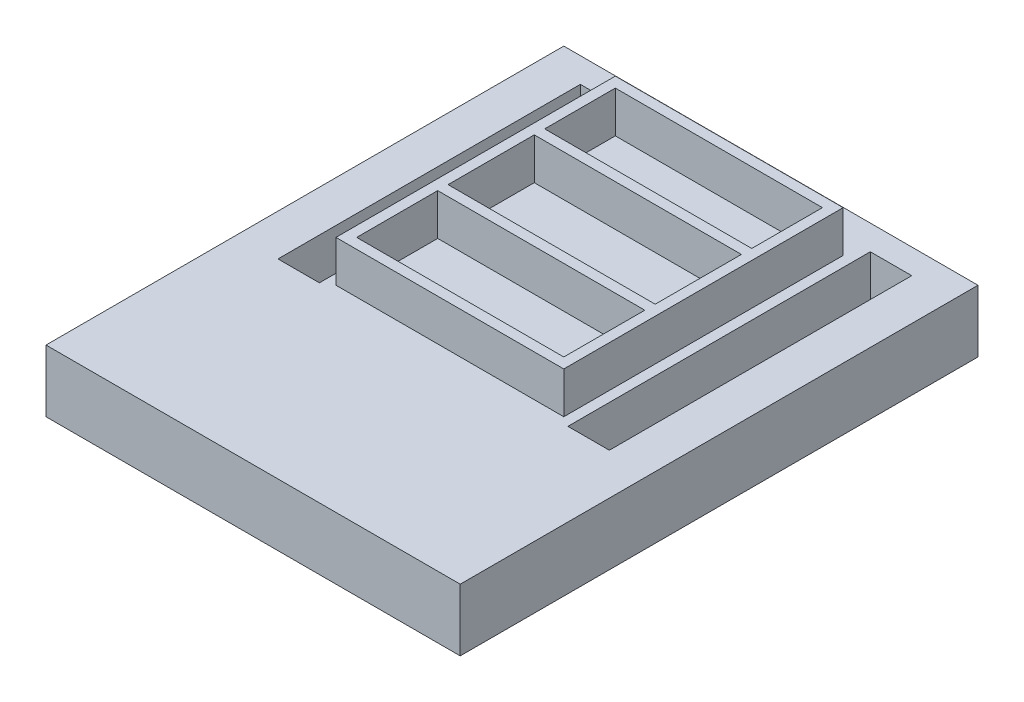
ISO-10303-21;
HEADER;
FILE_DESCRIPTION(('STEP AP214'),'2;1');
FILE_NAME('part.step','',(''),(''),'','','');
FILE_SCHEMA(('AUTOMOTIVE_DESIGN { 1 0 10303 214 1 1 1 1 }'));
ENDSEC;
DATA;
#1=APPLICATION_CONTEXT('core data for automotive mechanical design processes');
#2=APPLICATION_PROTOCOL_DEFINITION('international standard','automotive_design',2000,#1);
#3=PRODUCT_CONTEXT('',#1,'mechanical');
#4=PRODUCT('Part','Part','',(#3));
#5=PRODUCT_RELATED_PRODUCT_CATEGORY('part','',(#4));
#6=PRODUCT_DEFINITION_FORMATION('','',#4);
#7=PRODUCT_DEFINITION_CONTEXT('part definition',#1,'design');
#8=PRODUCT_DEFINITION('design','',#6,#7);
#9=PRODUCT_DEFINITION_SHAPE('','',#8);
#10=(LENGTH_UNIT() NAMED_UNIT(*) SI_UNIT(.MILLI.,.METRE.));
#11=(NAMED_UNIT(*) PLANE_ANGLE_UNIT() SI_UNIT($,.RADIAN.));
#12=(NAMED_UNIT(*) SI_UNIT($,.STERADIAN.) SOLID_ANGLE_UNIT());
#13=UNCERTAINTY_MEASURE_WITH_UNIT(LENGTH_MEASURE(1.E-05),#10,'distance_accuracy_value','');
#14=(GEOMETRIC_REPRESENTATION_CONTEXT(3) GLOBAL_UNCERTAINTY_ASSIGNED_CONTEXT((#13)) GLOBAL_UNIT_ASSIGNED_CONTEXT((#10,
#11,#12)) REPRESENTATION_CONTEXT('',''));
#15=CARTESIAN_POINT('',(0.,0.,0.));
#16=DIRECTION('',(0.,0.,1.));
#17=DIRECTION('',(1.,0.,0.));
#18=AXIS2_PLACEMENT_3D('',#15,#16,#17);
#19=CARTESIAN_POINT('',(99.9999999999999,30.,-125.));
#20=DIRECTION('',(-1.,0.,0.));
#21=DIRECTION('',(0.,0.,1.));
#22=AXIS2_PLACEMENT_3D('',#19,#20,#21);
#23=PLANE('',#22);
#24=DIRECTION('',(0.,0.,-1.));
#25=VECTOR('',#24,1.);
#26=CARTESIAN_POINT('',(99.9999999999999,0.,-125.));
#27=LINE('',#26,#25);
#28=CARTESIAN_POINT('',(100.,0.,125.));
#29=VERTEX_POINT('',#28);
#30=CARTESIAN_POINT('',(99.9999999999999,0.,-125.));
#31=VERTEX_POINT('',#30);
#32=EDGE_CURVE('E327',#29,#31,#27,.T.);
#33=ORIENTED_EDGE('',*,*,#32,.T.);
#34=DIRECTION('',(0.,-1.,0.));
#35=VECTOR('',#34,1.);
#36=CARTESIAN_POINT('',(99.9999999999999,30.,-125.));
#37=LINE('',#36,#35);
#38=CARTESIAN_POINT('',(99.9999999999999,30.,-125.));
#39=VERTEX_POINT('',#38);
#40=EDGE_CURVE('E11',#39,#31,#37,.T.);
#41=ORIENTED_EDGE('',*,*,#40,.F.);
#42=DIRECTION('',(0.,0.,-1.));
#43=VECTOR('',#42,1.);
#44=CARTESIAN_POINT('',(99.9999999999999,30.,-125.));
#45=LINE('',#44,#43);
#46=CARTESIAN_POINT('',(100.,30.,125.));
#47=VERTEX_POINT('',#46);
#48=EDGE_CURVE('E328',#47,#39,#45,.T.);
#49=ORIENTED_EDGE('',*,*,#48,.F.);
#50=DIRECTION('',(0.,-1.,0.));
#51=VECTOR('',#50,1.);
#52=CARTESIAN_POINT('',(100.,30.,125.));
#53=LINE('',#52,#51);
#54=EDGE_CURVE('E338',#47,#29,#53,.T.);
#55=ORIENTED_EDGE('',*,*,#54,.T.);
#56=EDGE_LOOP('',(#33,#41,#49,#55));
#57=FACE_BOUND('',#56,.T.);
#58=ADVANCED_FACE('F41',(#57),#23,.F.);
#59=CARTESIAN_POINT('',(-100.,30.,-125.));
#60=DIRECTION('',(0.,0.,1.));
#61=DIRECTION('',(1.,0.,0.));
#62=AXIS2_PLACEMENT_3D('',#59,#60,#61);
#63=PLANE('',#62);
#64=DIRECTION('',(-1.,0.,0.));
#65=VECTOR('',#64,1.);
#66=CARTESIAN_POINT('',(-100.,0.,-125.));
#67=LINE('',#66,#65);
#68=CARTESIAN_POINT('',(-100.,0.,-125.));
#69=VERTEX_POINT('',#68);
#70=EDGE_CURVE('E341',#31,#69,#67,.T.);
#71=ORIENTED_EDGE('',*,*,#70,.T.);
#72=DIRECTION('',(0.,-1.,0.));
#73=VECTOR('',#72,1.);
#74=CARTESIAN_POINT('',(-100.,30.,-125.));
#75=LINE('',#74,#73);
#76=CARTESIAN_POINT('',(-100.,30.,-125.));
#77=VERTEX_POINT('',#76);
#78=EDGE_CURVE('E48',#77,#69,#75,.T.);
#79=ORIENTED_EDGE('',*,*,#78,.F.);
#80=DIRECTION('',(-1.,0.,0.));
#81=VECTOR('',#80,1.);
#82=CARTESIAN_POINT('',(-100.,30.,-125.));
#83=LINE('',#82,#81);
#84=EDGE_CURVE('E331',#39,#77,#83,.T.);
#85=ORIENTED_EDGE('',*,*,#84,.F.);
#86=ORIENTED_EDGE('',*,*,#40,.T.);
#87=EDGE_LOOP('',(#71,#79,#85,#86));
#88=FACE_BOUND('',#87,.T.);
#89=ADVANCED_FACE('F371',(#88),#63,.F.);
#90=CARTESIAN_POINT('',(-100.,30.,-125.));
#91=DIRECTION('',(1.,0.,0.));
#92=DIRECTION('',(0.,0.,-1.));
#93=AXIS2_PLACEMENT_3D('',#90,#91,#92);
#94=PLANE('',#93);
#95=DIRECTION('',(0.,0.,1.));
#96=VECTOR('',#95,1.);
#97=CARTESIAN_POINT('',(-100.,0.,-125.));
#98=LINE('',#97,#96);
#99=CARTESIAN_POINT('',(-100.,0.,125.));
#100=VERTEX_POINT('',#99);
#101=EDGE_CURVE('E343',#69,#100,#98,.T.);
#102=ORIENTED_EDGE('',*,*,#101,.T.);
#103=DIRECTION('',(0.,-1.,0.));
#104=VECTOR('',#103,1.);
#105=CARTESIAN_POINT('',(-100.,30.,125.));
#106=LINE('',#105,#104);
#107=CARTESIAN_POINT('',(-100.,30.,125.));
#108=VERTEX_POINT('',#107);
#109=EDGE_CURVE('E348',#108,#100,#106,.T.);
#110=ORIENTED_EDGE('',*,*,#109,.F.);
#111=DIRECTION('',(0.,0.,1.));
#112=VECTOR('',#111,1.);
#113=CARTESIAN_POINT('',(-100.,30.,-125.));
#114=LINE('',#113,#112);
#115=EDGE_CURVE('E334',#77,#108,#114,.T.);
#116=ORIENTED_EDGE('',*,*,#115,.F.);
#117=ORIENTED_EDGE('',*,*,#78,.T.);
#118=EDGE_LOOP('',(#102,#110,#116,#117));
#119=FACE_BOUND('',#118,.T.);
#120=ADVANCED_FACE('F355',(#119),#94,.F.);
#121=CARTESIAN_POINT('',(-100.,30.,125.));
#122=DIRECTION('',(0.,0.,-1.));
#123=DIRECTION('',(-1.,0.,0.));
#124=AXIS2_PLACEMENT_3D('',#121,#122,#123);
#125=PLANE('',#124);
#126=DIRECTION('',(1.,0.,0.));
#127=VECTOR('',#126,1.);
#128=CARTESIAN_POINT('',(-100.,0.,125.));
#129=LINE('',#128,#127);
#130=EDGE_CURVE('E332',#100,#29,#129,.T.);
#131=ORIENTED_EDGE('',*,*,#130,.T.);
#132=ORIENTED_EDGE('',*,*,#54,.F.);
#133=DIRECTION('',(1.,0.,0.));
#134=VECTOR('',#133,1.);
#135=CARTESIAN_POINT('',(-100.,30.,125.));
#136=LINE('',#135,#134);
#137=EDGE_CURVE('E336',#108,#47,#136,.T.);
#138=ORIENTED_EDGE('',*,*,#137,.F.);
#139=ORIENTED_EDGE('',*,*,#109,.T.);
#140=EDGE_LOOP('',(#131,#132,#138,#139));
#141=FACE_BOUND('',#140,.T.);
#142=ADVANCED_FACE('F364',(#141),#125,.F.);
#143=CARTESIAN_POINT('',(0.,30.,0.));
#144=DIRECTION('',(0.,1.,0.));
#145=DIRECTION('',(0.,0.,1.));
#146=AXIS2_PLACEMENT_3D('',#143,#144,#145);
#147=PLANE('',#146);
#148=DIRECTION('',(1.,0.,0.));
#149=VECTOR('',#148,1.);
#150=CARTESIAN_POINT('',(0.,30.,-104.89));
#151=LINE('',#150,#149);
#152=CARTESIAN_POINT('',(-55.,30.,-104.89));
#153=VERTEX_POINT('',#152);
#154=CARTESIAN_POINT('',(55.,30.,-104.89));
#155=VERTEX_POINT('',#154);
#156=EDGE_CURVE('E546',#153,#155,#151,.T.);
#157=ORIENTED_EDGE('',*,*,#156,.T.);
#158=DIRECTION('',(0.,0.,1.));
#159=VECTOR('',#158,1.);
#160=CARTESIAN_POINT('',(55.,30.,0.));
#161=LINE('',#160,#159);
#162=CARTESIAN_POINT('',(55.,30.,30.));
#163=VERTEX_POINT('',#162);
#164=EDGE_CURVE('E499',#155,#163,#161,.T.);
#165=ORIENTED_EDGE('',*,*,#164,.T.);
#166=DIRECTION('',(1.,0.,0.));
#167=VECTOR('',#166,1.);
#168=CARTESIAN_POINT('',(0.,30.,30.));
#169=LINE('',#168,#167);
#170=CARTESIAN_POINT('',(-55.,30.,30.));
#171=VERTEX_POINT('',#170);
#172=EDGE_CURVE('E60',#171,#163,#169,.T.);
#173=ORIENTED_EDGE('',*,*,#172,.F.);
#174=DIRECTION('',(0.,0.,1.));
#175=VECTOR('',#174,1.);
#176=CARTESIAN_POINT('',(-55.,30.,0.));
#177=LINE('',#176,#175);
#178=EDGE_CURVE('E55',#153,#171,#177,.T.);
#179=ORIENTED_EDGE('',*,*,#178,.F.);
#180=EDGE_LOOP('',(#157,#165,#173,#179));
#181=FACE_BOUND('',#180,.T.);
#182=DIRECTION('',(0.,0.,-1.));
#183=VECTOR('',#182,1.);
#184=CARTESIAN_POINT('',(80.,30.,0.));
#185=LINE('',#184,#183);
#186=CARTESIAN_POINT('',(80.,30.,33.));
#187=VERTEX_POINT('',#186);
#188=CARTESIAN_POINT('',(80.,30.,-113.));
#189=VERTEX_POINT('',#188);
#190=EDGE_CURVE('E324',#187,#189,#185,.T.);
#191=ORIENTED_EDGE('',*,*,#190,.F.);
#192=DIRECTION('',(1.,0.,0.));
#193=VECTOR('',#192,1.);
#194=CARTESIAN_POINT('',(0.,30.,33.));
#195=LINE('',#194,#193);
#196=CARTESIAN_POINT('',(60.,30.,33.));
#197=VERTEX_POINT('',#196);
#198=EDGE_CURVE('E322',#197,#187,#195,.T.);
#199=ORIENTED_EDGE('',*,*,#198,.F.);
#200=DIRECTION('',(0.,0.,1.));
#201=VECTOR('',#200,1.);
#202=CARTESIAN_POINT('',(60.,30.,0.));
#203=LINE('',#202,#201);
#204=CARTESIAN_POINT('',(60.,30.,-113.));
#205=VERTEX_POINT('',#204);
#206=EDGE_CURVE('E320',#205,#197,#203,.T.);
#207=ORIENTED_EDGE('',*,*,#206,.F.);
#208=DIRECTION('',(-1.,0.,0.));
#209=VECTOR('',#208,1.);
#210=CARTESIAN_POINT('',(0.,30.,-113.));
#211=LINE('',#210,#209);
#212=EDGE_CURVE('E318',#189,#205,#211,.T.);
#213=ORIENTED_EDGE('',*,*,#212,.F.);
#214=EDGE_LOOP('',(#191,#199,#207,#213));
#215=FACE_BOUND('',#214,.T.);
#216=DIRECTION('',(0.,0.,1.));
#217=VECTOR('',#216,1.);
#218=CARTESIAN_POINT('',(-80.,30.,0.));
#219=LINE('',#218,#217);
#220=CARTESIAN_POINT('',(-80.,30.,-113.));
#221=VERTEX_POINT('',#220);
#222=CARTESIAN_POINT('',(-80.,30.,33.));
#223=VERTEX_POINT('',#222);
#224=EDGE_CURVE('E315',#221,#223,#219,.T.);
#225=ORIENTED_EDGE('',*,*,#224,.F.);
#226=DIRECTION('',(-1.,0.,0.));
#227=VECTOR('',#226,1.);
#228=CARTESIAN_POINT('',(0.,30.,-113.));
#229=LINE('',#228,#227);
#230=CARTESIAN_POINT('',(-60.,30.,-113.));
#231=VERTEX_POINT('',#230);
#232=EDGE_CURVE('E313',#231,#221,#229,.T.);
#233=ORIENTED_EDGE('',*,*,#232,.F.);
#234=DIRECTION('',(0.,0.,-1.));
#235=VECTOR('',#234,1.);
#236=CARTESIAN_POINT('',(-60.,30.,0.));
#237=LINE('',#236,#235);
#238=CARTESIAN_POINT('',(-60.,30.,33.));
#239=VERTEX_POINT('',#238);
#240=EDGE_CURVE('E311',#239,#231,#237,.T.);
#241=ORIENTED_EDGE('',*,*,#240,.F.);
#242=DIRECTION('',(1.,0.,0.));
#243=VECTOR('',#242,1.);
#244=CARTESIAN_POINT('',(0.,30.,33.));
#245=LINE('',#244,#243);
#246=EDGE_CURVE('E279',#223,#239,#245,.T.);
#247=ORIENTED_EDGE('',*,*,#246,.F.);
#248=EDGE_LOOP('',(#225,#233,#241,#247));
#249=FACE_BOUND('',#248,.T.);
#250=ORIENTED_EDGE('',*,*,#48,.T.);
#251=ORIENTED_EDGE('',*,*,#84,.T.);
#252=ORIENTED_EDGE('',*,*,#115,.T.);
#253=ORIENTED_EDGE('',*,*,#137,.T.);
#254=EDGE_LOOP('',(#250,#251,#252,#253));
#255=FACE_BOUND('',#254,.T.);
#256=ADVANCED_FACE('F370',(#181,#215,#249,#255),#147,.T.);
#257=CARTESIAN_POINT('',(0.,0.,0.));
#258=DIRECTION('',(0.,1.,0.));
#259=DIRECTION('',(0.,0.,1.));
#260=AXIS2_PLACEMENT_3D('',#257,#258,#259);
#261=PLANE('',#260);
#262=DIRECTION('',(1.,0.,0.));
#263=VECTOR('',#262,1.);
#264=CARTESIAN_POINT('',(80.,0.,33.));
#265=LINE('',#264,#263);
#266=CARTESIAN_POINT('',(60.,0.,33.));
#267=VERTEX_POINT('',#266);
#268=CARTESIAN_POINT('',(80.,0.,33.));
#269=VERTEX_POINT('',#268);
#270=EDGE_CURVE('E272',#267,#269,#265,.T.);
#271=ORIENTED_EDGE('',*,*,#270,.T.);
#272=DIRECTION('',(0.,0.,-1.));
#273=VECTOR('',#272,1.);
#274=CARTESIAN_POINT('',(80.,0.,-113.));
#275=LINE('',#274,#273);
#276=CARTESIAN_POINT('',(80.,0.,-113.));
#277=VERTEX_POINT('',#276);
#278=EDGE_CURVE('E262',#269,#277,#275,.T.);
#279=ORIENTED_EDGE('',*,*,#278,.T.);
#280=DIRECTION('',(-1.,0.,0.));
#281=VECTOR('',#280,1.);
#282=CARTESIAN_POINT('',(80.,0.,-113.));
#283=LINE('',#282,#281);
#284=CARTESIAN_POINT('',(60.,0.,-113.));
#285=VERTEX_POINT('',#284);
#286=EDGE_CURVE('E265',#277,#285,#283,.T.);
#287=ORIENTED_EDGE('',*,*,#286,.T.);
#288=DIRECTION('',(0.,0.,1.));
#289=VECTOR('',#288,1.);
#290=CARTESIAN_POINT('',(60.,0.,-113.));
#291=LINE('',#290,#289);
#292=EDGE_CURVE('E269',#285,#267,#291,.T.);
#293=ORIENTED_EDGE('',*,*,#292,.T.);
#294=EDGE_LOOP('',(#271,#279,#287,#293));
#295=FACE_BOUND('',#294,.T.);
#296=DIRECTION('',(-1.,0.,0.));
#297=VECTOR('',#296,1.);
#298=CARTESIAN_POINT('',(-80.,0.,-113.));
#299=LINE('',#298,#297);
#300=CARTESIAN_POINT('',(-60.,0.,-113.));
#301=VERTEX_POINT('',#300);
#302=CARTESIAN_POINT('',(-80.,0.,-113.));
#303=VERTEX_POINT('',#302);
#304=EDGE_CURVE('E289',#301,#303,#299,.T.);
#305=ORIENTED_EDGE('',*,*,#304,.T.);
#306=DIRECTION('',(0.,0.,1.));
#307=VECTOR('',#306,1.);
#308=CARTESIAN_POINT('',(-80.,0.,-113.));
#309=LINE('',#308,#307);
#310=CARTESIAN_POINT('',(-80.,0.,33.));
#311=VERTEX_POINT('',#310);
#312=EDGE_CURVE('E266',#303,#311,#309,.T.);
#313=ORIENTED_EDGE('',*,*,#312,.T.);
#314=DIRECTION('',(1.,0.,0.));
#315=VECTOR('',#314,1.);
#316=CARTESIAN_POINT('',(-80.,0.,33.));
#317=LINE('',#316,#315);
#318=CARTESIAN_POINT('',(-60.,0.,33.));
#319=VERTEX_POINT('',#318);
#320=EDGE_CURVE('E305',#311,#319,#317,.T.);
#321=ORIENTED_EDGE('',*,*,#320,.T.);
#322=DIRECTION('',(0.,0.,-1.));
#323=VECTOR('',#322,1.);
#324=CARTESIAN_POINT('',(-60.,0.,-113.));
#325=LINE('',#324,#323);
#326=EDGE_CURVE('E302',#319,#301,#325,.T.);
#327=ORIENTED_EDGE('',*,*,#326,.T.);
#328=EDGE_LOOP('',(#305,#313,#321,#327));
#329=FACE_BOUND('',#328,.T.);
#330=ORIENTED_EDGE('',*,*,#32,.F.);
#331=ORIENTED_EDGE('',*,*,#130,.F.);
#332=ORIENTED_EDGE('',*,*,#101,.F.);
#333=ORIENTED_EDGE('',*,*,#70,.F.);
#334=EDGE_LOOP('',(#330,#331,#332,#333));
#335=FACE_BOUND('',#334,.T.);
#336=ADVANCED_FACE('F361',(#295,#329,#335),#261,.F.);
#337=CARTESIAN_POINT('',(-80.,0.,-113.));
#338=DIRECTION('',(-1.,0.,0.));
#339=DIRECTION('',(0.,0.,1.));
#340=AXIS2_PLACEMENT_3D('',#337,#338,#339);
#341=PLANE('',#340);
#342=ORIENTED_EDGE('',*,*,#224,.T.);
#343=DIRECTION('',(0.,1.,0.));
#344=VECTOR('',#343,1.);
#345=CARTESIAN_POINT('',(-80.,0.,33.));
#346=LINE('',#345,#344);
#347=EDGE_CURVE('E287',#311,#223,#346,.T.);
#348=ORIENTED_EDGE('',*,*,#347,.F.);
#349=ORIENTED_EDGE('',*,*,#312,.F.);
#350=DIRECTION('',(0.,1.,0.));
#351=VECTOR('',#350,1.);
#352=CARTESIAN_POINT('',(-80.,0.,-113.));
#353=LINE('',#352,#351);
#354=EDGE_CURVE('E296',#303,#221,#353,.T.);
#355=ORIENTED_EDGE('',*,*,#354,.T.);
#356=EDGE_LOOP('',(#342,#348,#349,#355));
#357=FACE_BOUND('',#356,.T.);
#358=ADVANCED_FACE('F383',(#357),#341,.F.);
#359=CARTESIAN_POINT('',(-80.,0.,-113.));
#360=DIRECTION('',(0.,0.,-1.));
#361=DIRECTION('',(-1.,0.,0.));
#362=AXIS2_PLACEMENT_3D('',#359,#360,#361);
#363=PLANE('',#362);
#364=ORIENTED_EDGE('',*,*,#232,.T.);
#365=ORIENTED_EDGE('',*,*,#354,.F.);
#366=ORIENTED_EDGE('',*,*,#304,.F.);
#367=DIRECTION('',(0.,1.,0.));
#368=VECTOR('',#367,1.);
#369=CARTESIAN_POINT('',(-60.,0.,-113.));
#370=LINE('',#369,#368);
#371=EDGE_CURVE('E293',#301,#231,#370,.T.);
#372=ORIENTED_EDGE('',*,*,#371,.T.);
#373=EDGE_LOOP('',(#364,#365,#366,#372));
#374=FACE_BOUND('',#373,.T.);
#375=ADVANCED_FACE('F389',(#374),#363,.F.);
#376=CARTESIAN_POINT('',(-60.,0.,-113.));
#377=DIRECTION('',(1.,0.,0.));
#378=DIRECTION('',(0.,0.,-1.));
#379=AXIS2_PLACEMENT_3D('',#376,#377,#378);
#380=PLANE('',#379);
#381=ORIENTED_EDGE('',*,*,#240,.T.);
#382=ORIENTED_EDGE('',*,*,#371,.F.);
#383=ORIENTED_EDGE('',*,*,#326,.F.);
#384=DIRECTION('',(0.,1.,0.));
#385=VECTOR('',#384,1.);
#386=CARTESIAN_POINT('',(-60.,0.,33.));
#387=LINE('',#386,#385);
#388=EDGE_CURVE('E290',#319,#239,#387,.T.);
#389=ORIENTED_EDGE('',*,*,#388,.T.);
#390=EDGE_LOOP('',(#381,#382,#383,#389));
#391=FACE_BOUND('',#390,.T.);
#392=ADVANCED_FACE('F392',(#391),#380,.F.);
#393=CARTESIAN_POINT('',(-80.,0.,33.));
#394=DIRECTION('',(0.,0.,1.));
#395=DIRECTION('',(1.,0.,0.));
#396=AXIS2_PLACEMENT_3D('',#393,#394,#395);
#397=PLANE('',#396);
#398=ORIENTED_EDGE('',*,*,#246,.T.);
#399=ORIENTED_EDGE('',*,*,#388,.F.);
#400=ORIENTED_EDGE('',*,*,#320,.F.);
#401=ORIENTED_EDGE('',*,*,#347,.T.);
#402=EDGE_LOOP('',(#398,#399,#400,#401));
#403=FACE_BOUND('',#402,.T.);
#404=ADVANCED_FACE('F396',(#403),#397,.F.);
#405=CARTESIAN_POINT('',(80.,0.,-113.));
#406=DIRECTION('',(1.,0.,0.));
#407=DIRECTION('',(0.,0.,-1.));
#408=AXIS2_PLACEMENT_3D('',#405,#406,#407);
#409=PLANE('',#408);
#410=ORIENTED_EDGE('',*,*,#190,.T.);
#411=DIRECTION('',(0.,1.,0.));
#412=VECTOR('',#411,1.);
#413=CARTESIAN_POINT('',(80.,0.,-113.));
#414=LINE('',#413,#412);
#415=EDGE_CURVE('E275',#277,#189,#414,.T.);
#416=ORIENTED_EDGE('',*,*,#415,.F.);
#417=ORIENTED_EDGE('',*,*,#278,.F.);
#418=DIRECTION('',(0.,1.,0.));
#419=VECTOR('',#418,1.);
#420=CARTESIAN_POINT('',(80.,0.,33.));
#421=LINE('',#420,#419);
#422=EDGE_CURVE('E276',#269,#187,#421,.T.);
#423=ORIENTED_EDGE('',*,*,#422,.T.);
#424=EDGE_LOOP('',(#410,#416,#417,#423));
#425=FACE_BOUND('',#424,.T.);
#426=ADVANCED_FACE('F400',(#425),#409,.F.);
#427=CARTESIAN_POINT('',(80.,0.,33.));
#428=DIRECTION('',(0.,0.,1.));
#429=DIRECTION('',(1.,0.,0.));
#430=AXIS2_PLACEMENT_3D('',#427,#428,#429);
#431=PLANE('',#430);
#432=ORIENTED_EDGE('',*,*,#198,.T.);
#433=ORIENTED_EDGE('',*,*,#422,.F.);
#434=ORIENTED_EDGE('',*,*,#270,.F.);
#435=DIRECTION('',(0.,1.,0.));
#436=VECTOR('',#435,1.);
#437=CARTESIAN_POINT('',(60.,0.,33.));
#438=LINE('',#437,#436);
#439=EDGE_CURVE('E280',#267,#197,#438,.T.);
#440=ORIENTED_EDGE('',*,*,#439,.T.);
#441=EDGE_LOOP('',(#432,#433,#434,#440));
#442=FACE_BOUND('',#441,.T.);
#443=ADVANCED_FACE('F407',(#442),#431,.F.);
#444=CARTESIAN_POINT('',(60.,0.,-113.));
#445=DIRECTION('',(-1.,0.,0.));
#446=DIRECTION('',(0.,0.,1.));
#447=AXIS2_PLACEMENT_3D('',#444,#445,#446);
#448=PLANE('',#447);
#449=ORIENTED_EDGE('',*,*,#206,.T.);
#450=ORIENTED_EDGE('',*,*,#439,.F.);
#451=ORIENTED_EDGE('',*,*,#292,.F.);
#452=DIRECTION('',(0.,1.,0.));
#453=VECTOR('',#452,1.);
#454=CARTESIAN_POINT('',(60.,0.,-113.));
#455=LINE('',#454,#453);
#456=EDGE_CURVE('E283',#285,#205,#455,.T.);
#457=ORIENTED_EDGE('',*,*,#456,.T.);
#458=EDGE_LOOP('',(#449,#450,#451,#457));
#459=FACE_BOUND('',#458,.T.);
#460=ADVANCED_FACE('F413',(#459),#448,.F.);
#461=CARTESIAN_POINT('',(80.,0.,-113.));
#462=DIRECTION('',(0.,0.,-1.));
#463=DIRECTION('',(-1.,0.,0.));
#464=AXIS2_PLACEMENT_3D('',#461,#462,#463);
#465=PLANE('',#464);
#466=ORIENTED_EDGE('',*,*,#212,.T.);
#467=ORIENTED_EDGE('',*,*,#456,.F.);
#468=ORIENTED_EDGE('',*,*,#286,.F.);
#469=ORIENTED_EDGE('',*,*,#415,.T.);
#470=EDGE_LOOP('',(#466,#467,#468,#469));
#471=FACE_BOUND('',#470,.T.);
#472=ADVANCED_FACE('F409',(#471),#465,.F.);
#473=CARTESIAN_POINT('',(0.,50.,-99.89));
#474=DIRECTION('',(0.,0.,-1.));
#475=DIRECTION('',(-1.,0.,0.));
#476=AXIS2_PLACEMENT_3D('',#473,#474,#475);
#477=PLANE('',#476);
#478=DIRECTION('',(1.,0.,0.));
#479=VECTOR('',#478,1.);
#480=CARTESIAN_POINT('',(0.,30.,-99.89));
#481=LINE('',#480,#479);
#482=CARTESIAN_POINT('',(-50.,30.,-99.89));
#483=VERTEX_POINT('',#482);
#484=CARTESIAN_POINT('',(50.,30.,-99.89));
#485=VERTEX_POINT('',#484);
#486=EDGE_CURVE('E483',#483,#485,#481,.T.);
#487=ORIENTED_EDGE('',*,*,#486,.T.);
#488=DIRECTION('',(0.,-1.,0.));
#489=VECTOR('',#488,1.);
#490=CARTESIAN_POINT('',(50.,50.,-99.89));
#491=LINE('',#490,#489);
#492=CARTESIAN_POINT('',(50.,50.,-99.89));
#493=VERTEX_POINT('',#492);
#494=EDGE_CURVE('E299',#493,#485,#491,.T.);
#495=ORIENTED_EDGE('',*,*,#494,.F.);
#496=DIRECTION('',(1.,0.,0.));
#497=VECTOR('',#496,1.);
#498=CARTESIAN_POINT('',(0.,50.,-99.89));
#499=LINE('',#498,#497);
#500=CARTESIAN_POINT('',(-50.,50.,-99.89));
#501=VERTEX_POINT('',#500);
#502=EDGE_CURVE('E563',#501,#493,#499,.T.);
#503=ORIENTED_EDGE('',*,*,#502,.F.);
#504=DIRECTION('',(0.,-1.,0.));
#505=VECTOR('',#504,1.);
#506=CARTESIAN_POINT('',(-50.,50.,-99.89));
#507=LINE('',#506,#505);
#508=EDGE_CURVE('E497',#501,#483,#507,.T.);
#509=ORIENTED_EDGE('',*,*,#508,.T.);
#510=EDGE_LOOP('',(#487,#495,#503,#509));
#511=FACE_BOUND('',#510,.T.);
#512=ADVANCED_FACE('F412',(#511),#477,.F.);
#513=CARTESIAN_POINT('',(50.,50.,0.));
#514=DIRECTION('',(1.,0.,0.));
#515=DIRECTION('',(0.,0.,-1.));
#516=AXIS2_PLACEMENT_3D('',#513,#514,#515);
#517=PLANE('',#516);
#518=DIRECTION('',(0.,0.,1.));
#519=VECTOR('',#518,1.);
#520=CARTESIAN_POINT('',(50.,30.,0.));
#521=LINE('',#520,#519);
#522=CARTESIAN_POINT('',(50.,30.,-65.76));
#523=VERTEX_POINT('',#522);
#524=EDGE_CURVE('E480',#485,#523,#521,.T.);
#525=ORIENTED_EDGE('',*,*,#524,.T.);
#526=DIRECTION('',(0.,-1.,0.));
#527=VECTOR('',#526,1.);
#528=CARTESIAN_POINT('',(50.,50.,-65.76));
#529=LINE('',#528,#527);
#530=CARTESIAN_POINT('',(50.,50.,-65.76));
#531=VERTEX_POINT('',#530);
#532=EDGE_CURVE('E495',#531,#523,#529,.T.);
#533=ORIENTED_EDGE('',*,*,#532,.F.);
#534=DIRECTION('',(0.,0.,1.));
#535=VECTOR('',#534,1.);
#536=CARTESIAN_POINT('',(50.,50.,0.));
#537=LINE('',#536,#535);
#538=EDGE_CURVE('E239',#493,#531,#537,.T.);
#539=ORIENTED_EDGE('',*,*,#538,.F.);
#540=ORIENTED_EDGE('',*,*,#494,.T.);
#541=EDGE_LOOP('',(#525,#533,#539,#540));
#542=FACE_BOUND('',#541,.T.);
#543=ADVANCED_FACE('F456',(#542),#517,.F.);
#544=CARTESIAN_POINT('',(0.,50.,-65.76));
#545=DIRECTION('',(0.,0.,-1.));
#546=DIRECTION('',(-1.,0.,0.));
#547=AXIS2_PLACEMENT_3D('',#544,#545,#546);
#548=PLANE('',#547);
#549=DIRECTION('',(1.,0.,0.));
#550=VECTOR('',#549,1.);
#551=CARTESIAN_POINT('',(0.,30.,-65.76));
#552=LINE('',#551,#550);
#553=CARTESIAN_POINT('',(-50.,30.,-65.76));
#554=VERTEX_POINT('',#553);
#555=EDGE_CURVE('E486',#554,#523,#552,.T.);
#556=ORIENTED_EDGE('',*,*,#555,.F.);
#557=DIRECTION('',(0.,-1.,0.));
#558=VECTOR('',#557,1.);
#559=CARTESIAN_POINT('',(-50.,50.,-65.76));
#560=LINE('',#559,#558);
#561=CARTESIAN_POINT('',(-50.,50.,-65.76));
#562=VERTEX_POINT('',#561);
#563=EDGE_CURVE('E506',#562,#554,#560,.T.);
#564=ORIENTED_EDGE('',*,*,#563,.F.);
#565=DIRECTION('',(1.,0.,0.));
#566=VECTOR('',#565,1.);
#567=CARTESIAN_POINT('',(0.,50.,-65.76));
#568=LINE('',#567,#566);
#569=EDGE_CURVE('E569',#562,#531,#568,.T.);
#570=ORIENTED_EDGE('',*,*,#569,.T.);
#571=ORIENTED_EDGE('',*,*,#532,.T.);
#572=EDGE_LOOP('',(#556,#564,#570,#571));
#573=FACE_BOUND('',#572,.T.);
#574=ADVANCED_FACE('F442',(#573),#548,.T.);
#575=CARTESIAN_POINT('',(0.,50.,-104.89));
#576=DIRECTION('',(0.,0.,-1.));
#577=DIRECTION('',(-1.,0.,0.));
#578=AXIS2_PLACEMENT_3D('',#575,#576,#577);
#579=PLANE('',#578);
#580=ORIENTED_EDGE('',*,*,#156,.F.);
#581=DIRECTION('',(0.,-1.,0.));
#582=VECTOR('',#581,1.);
#583=CARTESIAN_POINT('',(-55.,50.,-104.89));
#584=LINE('',#583,#582);
#585=CARTESIAN_POINT('',(-55.,50.,-104.89));
#586=VERTEX_POINT('',#585);
#587=EDGE_CURVE('E507',#586,#153,#584,.T.);
#588=ORIENTED_EDGE('',*,*,#587,.F.);
#589=DIRECTION('',(1.,0.,0.));
#590=VECTOR('',#589,1.);
#591=CARTESIAN_POINT('',(0.,50.,-104.89));
#592=LINE('',#591,#590);
#593=CARTESIAN_POINT('',(55.,50.,-104.89));
#594=VERTEX_POINT('',#593);
#595=EDGE_CURVE('E589',#586,#594,#592,.T.);
#596=ORIENTED_EDGE('',*,*,#595,.T.);
#597=DIRECTION('',(0.,-1.,0.));
#598=VECTOR('',#597,1.);
#599=CARTESIAN_POINT('',(55.,50.,-104.89));
#600=LINE('',#599,#598);
#601=EDGE_CURVE('E511',#594,#155,#600,.T.);
#602=ORIENTED_EDGE('',*,*,#601,.T.);
#603=EDGE_LOOP('',(#580,#588,#596,#602));
#604=FACE_BOUND('',#603,.T.);
#605=ADVANCED_FACE('F438',(#604),#579,.T.);
#606=CARTESIAN_POINT('',(-55.,50.,0.));
#607=DIRECTION('',(1.,0.,0.));
#608=DIRECTION('',(0.,0.,-1.));
#609=AXIS2_PLACEMENT_3D('',#606,#607,#608);
#610=PLANE('',#609);
#611=ORIENTED_EDGE('',*,*,#178,.T.);
#612=DIRECTION('',(0.,-1.,0.));
#613=VECTOR('',#612,1.);
#614=CARTESIAN_POINT('',(-55.,50.,30.));
#615=LINE('',#614,#613);
#616=CARTESIAN_POINT('',(-55.,50.,30.));
#617=VERTEX_POINT('',#616);
#618=EDGE_CURVE('E518',#617,#171,#615,.T.);
#619=ORIENTED_EDGE('',*,*,#618,.F.);
#620=DIRECTION('',(0.,0.,1.));
#621=VECTOR('',#620,1.);
#622=CARTESIAN_POINT('',(-55.,50.,0.));
#623=LINE('',#622,#621);
#624=EDGE_CURVE('E555',#586,#617,#623,.T.);
#625=ORIENTED_EDGE('',*,*,#624,.F.);
#626=ORIENTED_EDGE('',*,*,#587,.T.);
#627=EDGE_LOOP('',(#611,#619,#625,#626));
#628=FACE_BOUND('',#627,.T.);
#629=ADVANCED_FACE('F441',(#628),#610,.F.);
#630=CARTESIAN_POINT('',(0.,50.,30.));
#631=DIRECTION('',(0.,0.,-1.));
#632=DIRECTION('',(-1.,0.,0.));
#633=AXIS2_PLACEMENT_3D('',#630,#631,#632);
#634=PLANE('',#633);
#635=ORIENTED_EDGE('',*,*,#172,.T.);
#636=DIRECTION('',(0.,-1.,0.));
#637=VECTOR('',#636,1.);
#638=CARTESIAN_POINT('',(55.,50.,30.));
#639=LINE('',#638,#637);
#640=CARTESIAN_POINT('',(55.,50.,30.));
#641=VERTEX_POINT('',#640);
#642=EDGE_CURVE('E514',#641,#163,#639,.T.);
#643=ORIENTED_EDGE('',*,*,#642,.F.);
#644=DIRECTION('',(1.,0.,0.));
#645=VECTOR('',#644,1.);
#646=CARTESIAN_POINT('',(0.,50.,30.));
#647=LINE('',#646,#645);
#648=EDGE_CURVE('E551',#617,#641,#647,.T.);
#649=ORIENTED_EDGE('',*,*,#648,.F.);
#650=ORIENTED_EDGE('',*,*,#618,.T.);
#651=EDGE_LOOP('',(#635,#643,#649,#650));
#652=FACE_BOUND('',#651,.T.);
#653=ADVANCED_FACE('F433',(#652),#634,.F.);
#654=CARTESIAN_POINT('',(0.,50.,-14.13));
#655=DIRECTION('',(0.,0.,-1.));
#656=DIRECTION('',(-1.,0.,0.));
#657=AXIS2_PLACEMENT_3D('',#654,#655,#656);
#658=PLANE('',#657);
#659=DIRECTION('',(1.,0.,0.));
#660=VECTOR('',#659,1.);
#661=CARTESIAN_POINT('',(0.,30.,-14.13));
#662=LINE('',#661,#660);
#663=CARTESIAN_POINT('',(-50.,30.,-14.13));
#664=VERTEX_POINT('',#663);
#665=CARTESIAN_POINT('',(50.,30.,-14.13));
#666=VERTEX_POINT('',#665);
#667=EDGE_CURVE('E537',#664,#666,#662,.T.);
#668=ORIENTED_EDGE('',*,*,#667,.T.);
#669=DIRECTION('',(0.,-1.,0.));
#670=VECTOR('',#669,1.);
#671=CARTESIAN_POINT('',(50.,50.,-14.13));
#672=LINE('',#671,#670);
#673=CARTESIAN_POINT('',(50.,50.,-14.13));
#674=VERTEX_POINT('',#673);
#675=EDGE_CURVE('E515',#674,#666,#672,.T.);
#676=ORIENTED_EDGE('',*,*,#675,.F.);
#677=DIRECTION('',(1.,0.,0.));
#678=VECTOR('',#677,1.);
#679=CARTESIAN_POINT('',(0.,50.,-14.13));
#680=LINE('',#679,#678);
#681=CARTESIAN_POINT('',(-50.,50.,-14.13));
#682=VERTEX_POINT('',#681);
#683=EDGE_CURVE('E578',#682,#674,#680,.T.);
#684=ORIENTED_EDGE('',*,*,#683,.F.);
#685=DIRECTION('',(0.,-1.,0.));
#686=VECTOR('',#685,1.);
#687=CARTESIAN_POINT('',(-50.,50.,-14.13));
#688=LINE('',#687,#686);
#689=EDGE_CURVE('E253',#682,#664,#688,.T.);
#690=ORIENTED_EDGE('',*,*,#689,.T.);
#691=EDGE_LOOP('',(#668,#676,#684,#690));
#692=FACE_BOUND('',#691,.T.);
#693=ADVANCED_FACE('F429',(#692),#658,.F.);
#694=CARTESIAN_POINT('',(50.,30.,25.));
#695=VERTEX_POINT('',#694);
#696=EDGE_CURVE('E490',#666,#695,#521,.T.);
#697=ORIENTED_EDGE('',*,*,#696,.T.);
#698=DIRECTION('',(0.,-1.,0.));
#699=VECTOR('',#698,1.);
#700=CARTESIAN_POINT('',(50.,50.,25.));
#701=LINE('',#700,#699);
#702=CARTESIAN_POINT('',(50.,50.,25.));
#703=VERTEX_POINT('',#702);
#704=EDGE_CURVE('E523',#703,#695,#701,.T.);
#705=ORIENTED_EDGE('',*,*,#704,.F.);
#706=EDGE_CURVE('E240',#674,#703,#537,.T.);
#707=ORIENTED_EDGE('',*,*,#706,.F.);
#708=ORIENTED_EDGE('',*,*,#675,.T.);
#709=EDGE_LOOP('',(#697,#705,#707,#708));
#710=FACE_BOUND('',#709,.T.);
#711=ADVANCED_FACE('F432',(#710),#517,.F.);
#712=CARTESIAN_POINT('',(0.,50.,25.));
#713=DIRECTION('',(0.,0.,-1.));
#714=DIRECTION('',(-1.,0.,0.));
#715=AXIS2_PLACEMENT_3D('',#712,#713,#714);
#716=PLANE('',#715);
#717=DIRECTION('',(1.,0.,0.));
#718=VECTOR('',#717,1.);
#719=CARTESIAN_POINT('',(0.,30.,25.));
#720=LINE('',#719,#718);
#721=CARTESIAN_POINT('',(-50.,30.,25.));
#722=VERTEX_POINT('',#721);
#723=EDGE_CURVE('E544',#722,#695,#720,.T.);
#724=ORIENTED_EDGE('',*,*,#723,.F.);
#725=DIRECTION('',(0.,-1.,0.));
#726=VECTOR('',#725,1.);
#727=CARTESIAN_POINT('',(-50.,50.,25.));
#728=LINE('',#727,#726);
#729=CARTESIAN_POINT('',(-50.,50.,25.));
#730=VERTEX_POINT('',#729);
#731=EDGE_CURVE('E256',#730,#722,#728,.T.);
#732=ORIENTED_EDGE('',*,*,#731,.F.);
#733=DIRECTION('',(1.,0.,0.));
#734=VECTOR('',#733,1.);
#735=CARTESIAN_POINT('',(0.,50.,25.));
#736=LINE('',#735,#734);
#737=EDGE_CURVE('E577',#730,#703,#736,.T.);
#738=ORIENTED_EDGE('',*,*,#737,.T.);
#739=ORIENTED_EDGE('',*,*,#704,.T.);
#740=EDGE_LOOP('',(#724,#732,#738,#739));
#741=FACE_BOUND('',#740,.T.);
#742=ADVANCED_FACE('F423',(#741),#716,.T.);
#743=CARTESIAN_POINT('',(0.,50.,-60.76));
#744=DIRECTION('',(0.,0.,-1.));
#745=DIRECTION('',(-1.,0.,0.));
#746=AXIS2_PLACEMENT_3D('',#743,#744,#745);
#747=PLANE('',#746);
#748=DIRECTION('',(1.,0.,0.));
#749=VECTOR('',#748,1.);
#750=CARTESIAN_POINT('',(0.,30.,-60.76));
#751=LINE('',#750,#749);
#752=CARTESIAN_POINT('',(-50.,30.,-60.76));
#753=VERTEX_POINT('',#752);
#754=CARTESIAN_POINT('',(50.,30.,-60.76));
#755=VERTEX_POINT('',#754);
#756=EDGE_CURVE('E252',#753,#755,#751,.T.);
#757=ORIENTED_EDGE('',*,*,#756,.T.);
#758=DIRECTION('',(0.,-1.,0.));
#759=VECTOR('',#758,1.);
#760=CARTESIAN_POINT('',(50.,50.,-60.76));
#761=LINE('',#760,#759);
#762=CARTESIAN_POINT('',(50.,50.,-60.76));
#763=VERTEX_POINT('',#762);
#764=EDGE_CURVE('E229',#763,#755,#761,.T.);
#765=ORIENTED_EDGE('',*,*,#764,.F.);
#766=DIRECTION('',(1.,0.,0.));
#767=VECTOR('',#766,1.);
#768=CARTESIAN_POINT('',(0.,50.,-60.76));
#769=LINE('',#768,#767);
#770=CARTESIAN_POINT('',(-50.,50.,-60.76));
#771=VERTEX_POINT('',#770);
#772=EDGE_CURVE('E237',#771,#763,#769,.T.);
#773=ORIENTED_EDGE('',*,*,#772,.F.);
#774=DIRECTION('',(0.,-1.,0.));
#775=VECTOR('',#774,1.);
#776=CARTESIAN_POINT('',(-50.,50.,-60.76));
#777=LINE('',#776,#775);
#778=EDGE_CURVE('E528',#771,#753,#777,.T.);
#779=ORIENTED_EDGE('',*,*,#778,.T.);
#780=EDGE_LOOP('',(#757,#765,#773,#779));
#781=FACE_BOUND('',#780,.T.);
#782=ADVANCED_FACE('F251',(#781),#747,.F.);
#783=CARTESIAN_POINT('',(50.,30.,-19.13));
#784=VERTEX_POINT('',#783);
#785=EDGE_CURVE('E491',#755,#784,#521,.T.);
#786=ORIENTED_EDGE('',*,*,#785,.T.);
#787=DIRECTION('',(0.,-1.,0.));
#788=VECTOR('',#787,1.);
#789=CARTESIAN_POINT('',(50.,50.,-19.13));
#790=LINE('',#789,#788);
#791=CARTESIAN_POINT('',(50.,50.,-19.13));
#792=VERTEX_POINT('',#791);
#793=EDGE_CURVE('E232',#792,#784,#790,.T.);
#794=ORIENTED_EDGE('',*,*,#793,.F.);
#795=EDGE_CURVE('E224',#763,#792,#537,.T.);
#796=ORIENTED_EDGE('',*,*,#795,.F.);
#797=ORIENTED_EDGE('',*,*,#764,.T.);
#798=EDGE_LOOP('',(#786,#794,#796,#797));
#799=FACE_BOUND('',#798,.T.);
#800=ADVANCED_FACE('F227',(#799),#517,.F.);
#801=CARTESIAN_POINT('',(0.,50.,-19.13));
#802=DIRECTION('',(0.,0.,-1.));
#803=DIRECTION('',(-1.,0.,0.));
#804=AXIS2_PLACEMENT_3D('',#801,#802,#803);
#805=PLANE('',#804);
#806=DIRECTION('',(1.,0.,0.));
#807=VECTOR('',#806,1.);
#808=CARTESIAN_POINT('',(0.,30.,-19.13));
#809=LINE('',#808,#807);
#810=CARTESIAN_POINT('',(-50.,30.,-19.13));
#811=VERTEX_POINT('',#810);
#812=EDGE_CURVE('E535',#811,#784,#809,.T.);
#813=ORIENTED_EDGE('',*,*,#812,.F.);
#814=DIRECTION('',(0.,-1.,0.));
#815=VECTOR('',#814,1.);
#816=CARTESIAN_POINT('',(-50.,50.,-19.13));
#817=LINE('',#816,#815);
#818=CARTESIAN_POINT('',(-50.,50.,-19.13));
#819=VERTEX_POINT('',#818);
#820=EDGE_CURVE('E258',#819,#811,#817,.T.);
#821=ORIENTED_EDGE('',*,*,#820,.F.);
#822=DIRECTION('',(1.,0.,0.));
#823=VECTOR('',#822,1.);
#824=CARTESIAN_POINT('',(0.,50.,-19.13));
#825=LINE('',#824,#823);
#826=EDGE_CURVE('E236',#819,#792,#825,.T.);
#827=ORIENTED_EDGE('',*,*,#826,.T.);
#828=ORIENTED_EDGE('',*,*,#793,.T.);
#829=EDGE_LOOP('',(#813,#821,#827,#828));
#830=FACE_BOUND('',#829,.T.);
#831=ADVANCED_FACE('F424',(#830),#805,.T.);
#832=CARTESIAN_POINT('',(55.,50.,0.));
#833=DIRECTION('',(1.,0.,0.));
#834=DIRECTION('',(0.,0.,-1.));
#835=AXIS2_PLACEMENT_3D('',#832,#833,#834);
#836=PLANE('',#835);
#837=ORIENTED_EDGE('',*,*,#164,.F.);
#838=ORIENTED_EDGE('',*,*,#601,.F.);
#839=DIRECTION('',(0.,0.,1.));
#840=VECTOR('',#839,1.);
#841=CARTESIAN_POINT('',(55.,50.,0.));
#842=LINE('',#841,#840);
#843=EDGE_CURVE('E561',#594,#641,#842,.T.);
#844=ORIENTED_EDGE('',*,*,#843,.T.);
#845=ORIENTED_EDGE('',*,*,#642,.T.);
#846=EDGE_LOOP('',(#837,#838,#844,#845));
#847=FACE_BOUND('',#846,.T.);
#848=ADVANCED_FACE('F427',(#847),#836,.T.);
#849=CARTESIAN_POINT('',(-50.,50.,0.));
#850=DIRECTION('',(1.,0.,0.));
#851=DIRECTION('',(0.,0.,-1.));
#852=AXIS2_PLACEMENT_3D('',#849,#850,#851);
#853=PLANE('',#852);
#854=DIRECTION('',(0.,0.,1.));
#855=VECTOR('',#854,1.);
#856=CARTESIAN_POINT('',(-50.,30.,0.));
#857=LINE('',#856,#855);
#858=EDGE_CURVE('E539',#664,#722,#857,.T.);
#859=ORIENTED_EDGE('',*,*,#858,.F.);
#860=ORIENTED_EDGE('',*,*,#689,.F.);
#861=DIRECTION('',(0.,0.,1.));
#862=VECTOR('',#861,1.);
#863=CARTESIAN_POINT('',(-50.,50.,0.));
#864=LINE('',#863,#862);
#865=EDGE_CURVE('E574',#682,#730,#864,.T.);
#866=ORIENTED_EDGE('',*,*,#865,.T.);
#867=ORIENTED_EDGE('',*,*,#731,.T.);
#868=EDGE_LOOP('',(#859,#860,#866,#867));
#869=FACE_BOUND('',#868,.T.);
#870=ADVANCED_FACE('F452',(#869),#853,.T.);
#871=EDGE_CURVE('E534',#753,#811,#857,.T.);
#872=ORIENTED_EDGE('',*,*,#871,.F.);
#873=ORIENTED_EDGE('',*,*,#778,.F.);
#874=EDGE_CURVE('E246',#771,#819,#864,.T.);
#875=ORIENTED_EDGE('',*,*,#874,.T.);
#876=ORIENTED_EDGE('',*,*,#820,.T.);
#877=EDGE_LOOP('',(#872,#873,#875,#876));
#878=FACE_BOUND('',#877,.T.);
#879=ADVANCED_FACE('F467',(#878),#853,.T.);
#880=EDGE_CURVE('E249',#483,#554,#857,.T.);
#881=ORIENTED_EDGE('',*,*,#880,.F.);
#882=ORIENTED_EDGE('',*,*,#508,.F.);
#883=EDGE_CURVE('E529',#501,#562,#864,.T.);
#884=ORIENTED_EDGE('',*,*,#883,.T.);
#885=ORIENTED_EDGE('',*,*,#563,.T.);
#886=EDGE_LOOP('',(#881,#882,#884,#885));
#887=FACE_BOUND('',#886,.T.);
#888=ADVANCED_FACE('F464',(#887),#853,.T.);
#889=CARTESIAN_POINT('',(0.,50.,0.));
#890=DIRECTION('',(0.,1.,0.));
#891=DIRECTION('',(0.,0.,1.));
#892=AXIS2_PLACEMENT_3D('',#889,#890,#891);
#893=PLANE('',#892);
#894=ORIENTED_EDGE('',*,*,#772,.T.);
#895=ORIENTED_EDGE('',*,*,#795,.T.);
#896=ORIENTED_EDGE('',*,*,#826,.F.);
#897=ORIENTED_EDGE('',*,*,#874,.F.);
#898=EDGE_LOOP('',(#894,#895,#896,#897));
#899=FACE_BOUND('',#898,.T.);
#900=ORIENTED_EDGE('',*,*,#683,.T.);
#901=ORIENTED_EDGE('',*,*,#706,.T.);
#902=ORIENTED_EDGE('',*,*,#737,.F.);
#903=ORIENTED_EDGE('',*,*,#865,.F.);
#904=EDGE_LOOP('',(#900,#901,#902,#903));
#905=FACE_BOUND('',#904,.T.);
#906=ORIENTED_EDGE('',*,*,#595,.F.);
#907=ORIENTED_EDGE('',*,*,#624,.T.);
#908=ORIENTED_EDGE('',*,*,#648,.T.);
#909=ORIENTED_EDGE('',*,*,#843,.F.);
#910=EDGE_LOOP('',(#906,#907,#908,#909));
#911=FACE_BOUND('',#910,.T.);
#912=ORIENTED_EDGE('',*,*,#502,.T.);
#913=ORIENTED_EDGE('',*,*,#538,.T.);
#914=ORIENTED_EDGE('',*,*,#569,.F.);
#915=ORIENTED_EDGE('',*,*,#883,.F.);
#916=EDGE_LOOP('',(#912,#913,#914,#915));
#917=FACE_BOUND('',#916,.T.);
#918=ADVANCED_FACE('F243',(#899,#905,#911,#917),#893,.T.);
#919=ORIENTED_EDGE('',*,*,#524,.F.);
#920=ORIENTED_EDGE('',*,*,#486,.F.);
#921=ORIENTED_EDGE('',*,*,#880,.T.);
#922=ORIENTED_EDGE('',*,*,#555,.T.);
#923=EDGE_LOOP('',(#919,#920,#921,#922));
#924=FACE_BOUND('',#923,.T.);
#925=ADVANCED_FACE('F388',(#924),#147,.T.);
#926=ORIENTED_EDGE('',*,*,#785,.F.);
#927=ORIENTED_EDGE('',*,*,#756,.F.);
#928=ORIENTED_EDGE('',*,*,#871,.T.);
#929=ORIENTED_EDGE('',*,*,#812,.T.);
#930=EDGE_LOOP('',(#926,#927,#928,#929));
#931=FACE_BOUND('',#930,.T.);
#932=ADVANCED_FACE('F473',(#931),#147,.T.);
#933=ORIENTED_EDGE('',*,*,#696,.F.);
#934=ORIENTED_EDGE('',*,*,#667,.F.);
#935=ORIENTED_EDGE('',*,*,#858,.T.);
#936=ORIENTED_EDGE('',*,*,#723,.T.);
#937=EDGE_LOOP('',(#933,#934,#935,#936));
#938=FACE_BOUND('',#937,.T.);
#939=ADVANCED_FACE('F387',(#938),#147,.T.);
#940=CLOSED_SHELL('',(#58,#89,#120,#142,#256,#336,#358,#375,#392,#404,#426,#443,#460,#472,#512,
#543,#574,#605,#629,#653,#693,#711,#742,#782,#800,#831,#848,#870,#879,#888,#918,#925,#932,#939));
#941=MANIFOLD_SOLID_BREP('B2',#940);
#942=ADVANCED_BREP_SHAPE_REPRESENTATION('',(#18,#941),#14);
#943=SHAPE_DEFINITION_REPRESENTATION(#9,#942);
ENDSEC;
END-ISO-10303-21;
